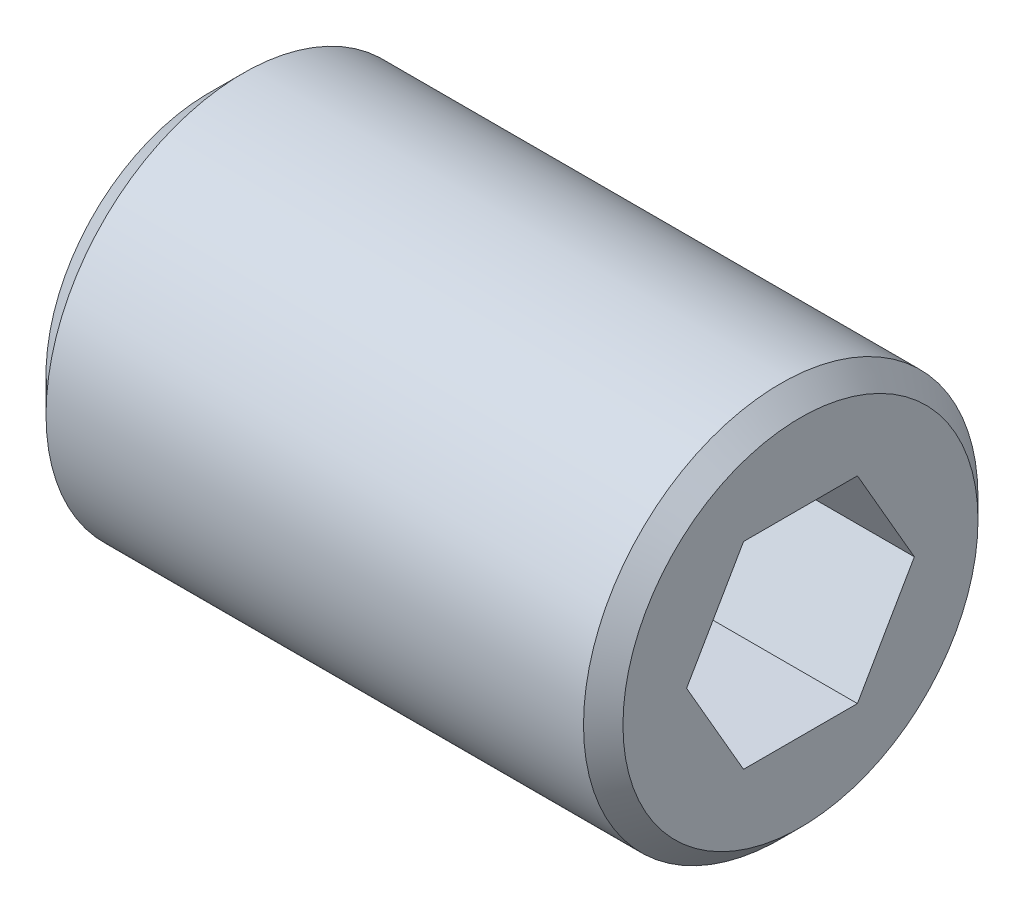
ISO-10303-21;
HEADER;
FILE_DESCRIPTION(('STEP AP214'),'2;1');
FILE_NAME('part.step','',(''),(''),'','','');
FILE_SCHEMA(('AUTOMOTIVE_DESIGN { 1 0 10303 214 1 1 1 1 }'));
ENDSEC;
DATA;
#1=APPLICATION_CONTEXT('core data for automotive mechanical design processes');
#2=APPLICATION_PROTOCOL_DEFINITION('international standard','automotive_design',2000,#1);
#3=PRODUCT_CONTEXT('',#1,'mechanical');
#4=PRODUCT('Part','Part','',(#3));
#5=PRODUCT_RELATED_PRODUCT_CATEGORY('part','',(#4));
#6=PRODUCT_DEFINITION_FORMATION('','',#4);
#7=PRODUCT_DEFINITION_CONTEXT('part definition',#1,'design');
#8=PRODUCT_DEFINITION('design','',#6,#7);
#9=PRODUCT_DEFINITION_SHAPE('','',#8);
#10=(LENGTH_UNIT() NAMED_UNIT(*) SI_UNIT(.MILLI.,.METRE.));
#11=(NAMED_UNIT(*) PLANE_ANGLE_UNIT() SI_UNIT($,.RADIAN.));
#12=(NAMED_UNIT(*) SI_UNIT($,.STERADIAN.) SOLID_ANGLE_UNIT());
#13=UNCERTAINTY_MEASURE_WITH_UNIT(LENGTH_MEASURE(1.E-05),#10,'distance_accuracy_value','');
#14=(GEOMETRIC_REPRESENTATION_CONTEXT(3) GLOBAL_UNCERTAINTY_ASSIGNED_CONTEXT((#13)) GLOBAL_UNIT_ASSIGNED_CONTEXT((#10,
#11,#12)) REPRESENTATION_CONTEXT('',''));
#15=CARTESIAN_POINT('',(0.,0.,0.));
#16=DIRECTION('',(0.,0.,1.));
#17=DIRECTION('',(1.,0.,0.));
#18=AXIS2_PLACEMENT_3D('',#15,#16,#17);
#19=CARTESIAN_POINT('',(-13.2930771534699,0.,0.));
#20=DIRECTION('',(-1.,0.,0.));
#21=DIRECTION('',(0.,0.,1.));
#22=AXIS2_PLACEMENT_3D('',#19,#20,#21);
#23=CYLINDRICAL_SURFACE('',#22,2.);
#24=CARTESIAN_POINT('',(-0.200000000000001,0.,0.));
#25=DIRECTION('',(-1.,0.,0.));
#26=DIRECTION('',(0.,0.,1.));
#27=AXIS2_PLACEMENT_3D('',#24,#25,#26);
#28=CIRCLE('',#27,2.);
#29=CARTESIAN_POINT('',(-0.200000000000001,0.,2.));
#30=VERTEX_POINT('',#29);
#31=EDGE_CURVE('E355',#30,#30,#28,.T.);
#32=ORIENTED_EDGE('',*,*,#31,.T.);
#33=EDGE_LOOP('',(#32));
#34=FACE_BOUND('',#33,.T.);
#35=CARTESIAN_POINT('',(-5.65,0.,0.));
#36=DIRECTION('',(1.,0.,0.));
#37=DIRECTION('',(0.,0.,-1.));
#38=AXIS2_PLACEMENT_3D('',#35,#36,#37);
#39=CIRCLE('',#38,2.);
#40=CARTESIAN_POINT('',(-5.65,0.,-2.));
#41=VERTEX_POINT('',#40);
#42=EDGE_CURVE('E459',#41,#41,#39,.T.);
#43=ORIENTED_EDGE('',*,*,#42,.T.);
#44=EDGE_LOOP('',(#43));
#45=FACE_BOUND('',#44,.T.);
#46=ADVANCED_FACE('F348',(#34,#45),#23,.T.);
#47=CARTESIAN_POINT('',(0.,2.,0.));
#48=DIRECTION('',(-1.,0.,0.));
#49=DIRECTION('',(0.,0.,1.));
#50=AXIS2_PLACEMENT_3D('',#47,#48,#49);
#51=PLANE('',#50);
#52=DIRECTION('',(0.,0.866025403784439,-0.5));
#53=VECTOR('',#52,1.);
#54=CARTESIAN_POINT('',(0.,-1.,-0.577350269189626));
#55=LINE('',#54,#53);
#56=CARTESIAN_POINT('',(0.,-1.,-0.577350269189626));
#57=VERTEX_POINT('',#56);
#58=CARTESIAN_POINT('',(0.,0.,-1.15470053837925));
#59=VERTEX_POINT('',#58);
#60=EDGE_CURVE('E416',#57,#59,#55,.T.);
#61=ORIENTED_EDGE('',*,*,#60,.F.);
#62=DIRECTION('',(0.,0.,-1.));
#63=VECTOR('',#62,1.);
#64=CARTESIAN_POINT('',(0.,-0.999999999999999,0.577350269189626));
#65=LINE('',#64,#63);
#66=CARTESIAN_POINT('',(0.,-0.999999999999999,0.577350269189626));
#67=VERTEX_POINT('',#66);
#68=EDGE_CURVE('E362',#67,#57,#65,.T.);
#69=ORIENTED_EDGE('',*,*,#68,.F.);
#70=DIRECTION('',(0.,-0.866025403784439,-0.5));
#71=VECTOR('',#70,1.);
#72=CARTESIAN_POINT('',(0.,0.,1.15470053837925));
#73=LINE('',#72,#71);
#74=CARTESIAN_POINT('',(0.,0.,1.15470053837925));
#75=VERTEX_POINT('',#74);
#76=EDGE_CURVE('E432',#75,#67,#73,.T.);
#77=ORIENTED_EDGE('',*,*,#76,.F.);
#78=DIRECTION('',(0.,-0.866025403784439,0.5));
#79=VECTOR('',#78,1.);
#80=CARTESIAN_POINT('',(0.,1.,0.577350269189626));
#81=LINE('',#80,#79);
#82=CARTESIAN_POINT('',(0.,1.,0.577350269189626));
#83=VERTEX_POINT('',#82);
#84=EDGE_CURVE('E426',#83,#75,#81,.T.);
#85=ORIENTED_EDGE('',*,*,#84,.F.);
#86=DIRECTION('',(0.,0.,1.));
#87=VECTOR('',#86,1.);
#88=CARTESIAN_POINT('',(0.,0.999999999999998,-0.577350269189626));
#89=LINE('',#88,#87);
#90=CARTESIAN_POINT('',(0.,0.999999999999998,-0.577350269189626));
#91=VERTEX_POINT('',#90);
#92=EDGE_CURVE('E424',#91,#83,#89,.T.);
#93=ORIENTED_EDGE('',*,*,#92,.F.);
#94=DIRECTION('',(0.,0.866025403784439,0.5));
#95=VECTOR('',#94,1.);
#96=CARTESIAN_POINT('',(0.,0.,-1.15470053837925));
#97=LINE('',#96,#95);
#98=EDGE_CURVE('E405',#59,#91,#97,.T.);
#99=ORIENTED_EDGE('',*,*,#98,.F.);
#100=EDGE_LOOP('',(#61,#69,#77,#85,#93,#99));
#101=FACE_BOUND('',#100,.T.);
#102=CARTESIAN_POINT('',(0.,0.,0.));
#103=DIRECTION('',(-1.,0.,0.));
#104=DIRECTION('',(0.,0.,1.));
#105=AXIS2_PLACEMENT_3D('',#102,#103,#104);
#106=CIRCLE('',#105,1.8);
#107=CARTESIAN_POINT('',(0.,0.,1.8));
#108=VERTEX_POINT('',#107);
#109=EDGE_CURVE('E11',#108,#108,#106,.F.);
#110=ORIENTED_EDGE('',*,*,#109,.T.);
#111=EDGE_LOOP('',(#110));
#112=FACE_BOUND('',#111,.T.);
#113=ADVANCED_FACE('F420',(#101,#112),#51,.F.);
#114=CARTESIAN_POINT('',(-6.,0.,0.));
#115=DIRECTION('',(1.,0.,0.));
#116=DIRECTION('',(0.,0.,-1.));
#117=AXIS2_PLACEMENT_3D('',#114,#115,#116);
#118=PLANE('',#117);
#119=CARTESIAN_POINT('',(-6.,0.,0.));
#120=DIRECTION('',(1.,0.,0.));
#121=DIRECTION('',(0.,0.,-1.));
#122=AXIS2_PLACEMENT_3D('',#119,#120,#121);
#123=CIRCLE('',#122,1.65);
#124=CARTESIAN_POINT('',(-6.,0.,-1.65));
#125=VERTEX_POINT('',#124);
#126=EDGE_CURVE('E450',#125,#125,#123,.F.);
#127=ORIENTED_EDGE('',*,*,#126,.T.);
#128=EDGE_LOOP('',(#127));
#129=FACE_BOUND('',#128,.T.);
#130=ADVANCED_FACE('F478',(#129),#118,.F.);
#131=CARTESIAN_POINT('',(-6.,0.,0.));
#132=DIRECTION('',(1.,0.,0.));
#133=DIRECTION('',(0.,0.,-1.));
#134=AXIS2_PLACEMENT_3D('',#131,#132,#133);
#135=CONICAL_SURFACE('',#134,1.65,0.785398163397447);
#136=ORIENTED_EDGE('',*,*,#42,.F.);
#137=EDGE_LOOP('',(#136));
#138=FACE_BOUND('',#137,.T.);
#139=ORIENTED_EDGE('',*,*,#126,.F.);
#140=EDGE_LOOP('',(#139));
#141=FACE_BOUND('',#140,.T.);
#142=ADVANCED_FACE('F469',(#138,#141),#135,.T.);
#143=CARTESIAN_POINT('',(-0.200000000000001,0.,0.));
#144=DIRECTION('',(-1.,0.,0.));
#145=DIRECTION('',(0.,0.,1.));
#146=AXIS2_PLACEMENT_3D('',#143,#144,#145);
#147=CONICAL_SURFACE('',#146,2.,0.785398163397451);
#148=ORIENTED_EDGE('',*,*,#109,.F.);
#149=EDGE_LOOP('',(#148));
#150=FACE_BOUND('',#149,.T.);
#151=ORIENTED_EDGE('',*,*,#31,.F.);
#152=EDGE_LOOP('',(#151));
#153=FACE_BOUND('',#152,.T.);
#154=ADVANCED_FACE('F466',(#150,#153),#147,.T.);
#155=CARTESIAN_POINT('',(-2.30000000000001,-0.999999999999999,0.577350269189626));
#156=DIRECTION('',(0.,-1.,0.));
#157=DIRECTION('',(0.,0.,-1.));
#158=AXIS2_PLACEMENT_3D('',#155,#156,#157);
#159=PLANE('',#158);
#160=ORIENTED_EDGE('',*,*,#68,.T.);
#161=DIRECTION('',(1.,0.,0.));
#162=VECTOR('',#161,1.);
#163=CARTESIAN_POINT('',(-2.30000000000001,-1.,-0.577350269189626));
#164=LINE('',#163,#162);
#165=CARTESIAN_POINT('',(-2.30000000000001,-1.,-0.577350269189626));
#166=VERTEX_POINT('',#165);
#167=EDGE_CURVE('E413',#166,#57,#164,.T.);
#168=ORIENTED_EDGE('',*,*,#167,.F.);
#169=DIRECTION('',(0.,0.,-1.));
#170=VECTOR('',#169,1.);
#171=CARTESIAN_POINT('',(-2.30000000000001,-0.999999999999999,0.577350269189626));
#172=LINE('',#171,#170);
#173=CARTESIAN_POINT('',(-2.30000000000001,-0.999999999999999,0.577350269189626));
#174=VERTEX_POINT('',#173);
#175=EDGE_CURVE('E434',#174,#166,#172,.T.);
#176=ORIENTED_EDGE('',*,*,#175,.F.);
#177=DIRECTION('',(1.,0.,0.));
#178=VECTOR('',#177,1.);
#179=CARTESIAN_POINT('',(-2.30000000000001,-0.999999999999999,0.577350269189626));
#180=LINE('',#179,#178);
#181=EDGE_CURVE('E369',#174,#67,#180,.T.);
#182=ORIENTED_EDGE('',*,*,#181,.T.);
#183=EDGE_LOOP('',(#160,#168,#176,#182));
#184=FACE_BOUND('',#183,.T.);
#185=ADVANCED_FACE('F468',(#184),#159,.F.);
#186=CARTESIAN_POINT('',(-2.30000000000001,0.,1.15470053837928));
#187=DIRECTION('',(0.,-0.5,0.866025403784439));
#188=DIRECTION('',(0.,-0.866025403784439,-0.5));
#189=AXIS2_PLACEMENT_3D('',#186,#187,#188);
#190=PLANE('',#189);
#191=ORIENTED_EDGE('',*,*,#76,.T.);
#192=ORIENTED_EDGE('',*,*,#181,.F.);
#193=DIRECTION('',(0.,-0.866025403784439,-0.5));
#194=VECTOR('',#193,1.);
#195=CARTESIAN_POINT('',(-2.30000000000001,0.,1.15470053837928));
#196=LINE('',#195,#194);
#197=CARTESIAN_POINT('',(-2.30000000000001,0.,1.15470053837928));
#198=VERTEX_POINT('',#197);
#199=EDGE_CURVE('E446',#198,#174,#196,.T.);
#200=ORIENTED_EDGE('',*,*,#199,.F.);
#201=DIRECTION('',(1.,0.,0.));
#202=VECTOR('',#201,1.);
#203=CARTESIAN_POINT('',(-2.30000000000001,0.,1.15470053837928));
#204=LINE('',#203,#202);
#205=EDGE_CURVE('E451',#198,#75,#204,.T.);
#206=ORIENTED_EDGE('',*,*,#205,.T.);
#207=EDGE_LOOP('',(#191,#192,#200,#206));
#208=FACE_BOUND('',#207,.T.);
#209=ADVANCED_FACE('F476',(#208),#190,.F.);
#210=CARTESIAN_POINT('',(-2.29999999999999,1.,0.577350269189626));
#211=DIRECTION('',(0.,0.5,0.866025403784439));
#212=DIRECTION('',(0.,-0.866025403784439,0.5));
#213=AXIS2_PLACEMENT_3D('',#210,#211,#212);
#214=PLANE('',#213);
#215=ORIENTED_EDGE('',*,*,#84,.T.);
#216=ORIENTED_EDGE('',*,*,#205,.F.);
#217=DIRECTION('',(0.,-0.866025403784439,0.5));
#218=VECTOR('',#217,1.);
#219=CARTESIAN_POINT('',(-2.29999999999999,1.,0.577350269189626));
#220=LINE('',#219,#218);
#221=CARTESIAN_POINT('',(-2.29999999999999,1.,0.577350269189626));
#222=VERTEX_POINT('',#221);
#223=EDGE_CURVE('E443',#222,#198,#220,.T.);
#224=ORIENTED_EDGE('',*,*,#223,.F.);
#225=DIRECTION('',(1.,0.,0.));
#226=VECTOR('',#225,1.);
#227=CARTESIAN_POINT('',(-2.29999999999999,1.,0.577350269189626));
#228=LINE('',#227,#226);
#229=EDGE_CURVE('E453',#222,#83,#228,.T.);
#230=ORIENTED_EDGE('',*,*,#229,.T.);
#231=EDGE_LOOP('',(#215,#216,#224,#230));
#232=FACE_BOUND('',#231,.T.);
#233=ADVANCED_FACE('F506',(#232),#214,.F.);
#234=CARTESIAN_POINT('',(-2.29999999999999,0.999999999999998,-0.577350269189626));
#235=DIRECTION('',(0.,1.,0.));
#236=DIRECTION('',(0.,0.,1.));
#237=AXIS2_PLACEMENT_3D('',#234,#235,#236);
#238=PLANE('',#237);
#239=ORIENTED_EDGE('',*,*,#92,.T.);
#240=ORIENTED_EDGE('',*,*,#229,.F.);
#241=DIRECTION('',(0.,0.,1.));
#242=VECTOR('',#241,1.);
#243=CARTESIAN_POINT('',(-2.29999999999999,0.999999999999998,-0.577350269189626));
#244=LINE('',#243,#242);
#245=CARTESIAN_POINT('',(-2.29999999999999,0.999999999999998,-0.577350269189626));
#246=VERTEX_POINT('',#245);
#247=EDGE_CURVE('E440',#246,#222,#244,.T.);
#248=ORIENTED_EDGE('',*,*,#247,.F.);
#249=DIRECTION('',(1.,0.,0.));
#250=VECTOR('',#249,1.);
#251=CARTESIAN_POINT('',(-2.29999999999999,0.999999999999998,-0.577350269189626));
#252=LINE('',#251,#250);
#253=EDGE_CURVE('E412',#246,#91,#252,.T.);
#254=ORIENTED_EDGE('',*,*,#253,.T.);
#255=EDGE_LOOP('',(#239,#240,#248,#254));
#256=FACE_BOUND('',#255,.T.);
#257=ADVANCED_FACE('F503',(#256),#238,.F.);
#258=CARTESIAN_POINT('',(-2.29999999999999,0.,-1.15470053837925));
#259=DIRECTION('',(0.,0.5,-0.866025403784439));
#260=DIRECTION('',(0.,0.866025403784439,0.5));
#261=AXIS2_PLACEMENT_3D('',#258,#259,#260);
#262=PLANE('',#261);
#263=ORIENTED_EDGE('',*,*,#98,.T.);
#264=ORIENTED_EDGE('',*,*,#253,.F.);
#265=DIRECTION('',(0.,0.866025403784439,0.5));
#266=VECTOR('',#265,1.);
#267=CARTESIAN_POINT('',(-2.29999999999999,0.,-1.15470053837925));
#268=LINE('',#267,#266);
#269=CARTESIAN_POINT('',(-2.29999999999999,0.,-1.15470053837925));
#270=VERTEX_POINT('',#269);
#271=EDGE_CURVE('E408',#270,#246,#268,.T.);
#272=ORIENTED_EDGE('',*,*,#271,.F.);
#273=DIRECTION('',(1.,0.,0.));
#274=VECTOR('',#273,1.);
#275=CARTESIAN_POINT('',(-2.29999999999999,0.,-1.15470053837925));
#276=LINE('',#275,#274);
#277=EDGE_CURVE('E401',#270,#59,#276,.T.);
#278=ORIENTED_EDGE('',*,*,#277,.T.);
#279=EDGE_LOOP('',(#263,#264,#272,#278));
#280=FACE_BOUND('',#279,.T.);
#281=ADVANCED_FACE('F403',(#280),#262,.F.);
#282=CARTESIAN_POINT('',(-2.30000000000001,-1.,-0.577350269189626));
#283=DIRECTION('',(0.,-0.5,-0.866025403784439));
#284=DIRECTION('',(0.,0.866025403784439,-0.5));
#285=AXIS2_PLACEMENT_3D('',#282,#283,#284);
#286=PLANE('',#285);
#287=ORIENTED_EDGE('',*,*,#60,.T.);
#288=ORIENTED_EDGE('',*,*,#277,.F.);
#289=DIRECTION('',(0.,0.866025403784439,-0.5));
#290=VECTOR('',#289,1.);
#291=CARTESIAN_POINT('',(-2.30000000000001,-1.,-0.577350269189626));
#292=LINE('',#291,#290);
#293=EDGE_CURVE('E437',#166,#270,#292,.T.);
#294=ORIENTED_EDGE('',*,*,#293,.F.);
#295=ORIENTED_EDGE('',*,*,#167,.T.);
#296=EDGE_LOOP('',(#287,#288,#294,#295));
#297=FACE_BOUND('',#296,.T.);
#298=ADVANCED_FACE('F417',(#297),#286,.F.);
#299=CARTESIAN_POINT('',(-2.30000000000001,-0.999999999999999,-1.73205080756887));
#300=DIRECTION('',(1.,0.,0.));
#301=DIRECTION('',(0.,0.,-1.));
#302=AXIS2_PLACEMENT_3D('',#299,#300,#301);
#303=PLANE('',#302);
#304=ORIENTED_EDGE('',*,*,#175,.T.);
#305=ORIENTED_EDGE('',*,*,#293,.T.);
#306=ORIENTED_EDGE('',*,*,#271,.T.);
#307=ORIENTED_EDGE('',*,*,#247,.T.);
#308=ORIENTED_EDGE('',*,*,#223,.T.);
#309=ORIENTED_EDGE('',*,*,#199,.T.);
#310=EDGE_LOOP('',(#304,#305,#306,#307,#308,#309));
#311=FACE_BOUND('',#310,.T.);
#312=ADVANCED_FACE('F500',(#311),#303,.T.);
#313=CLOSED_SHELL('',(#46,#113,#130,#142,#154,#185,#209,#233,#257,#281,#298,#312));
#314=MANIFOLD_SOLID_BREP('B2',#313);
#315=ADVANCED_BREP_SHAPE_REPRESENTATION('',(#18,#314),#14);
#316=SHAPE_DEFINITION_REPRESENTATION(#9,#315);
ENDSEC;
END-ISO-10303-21;
